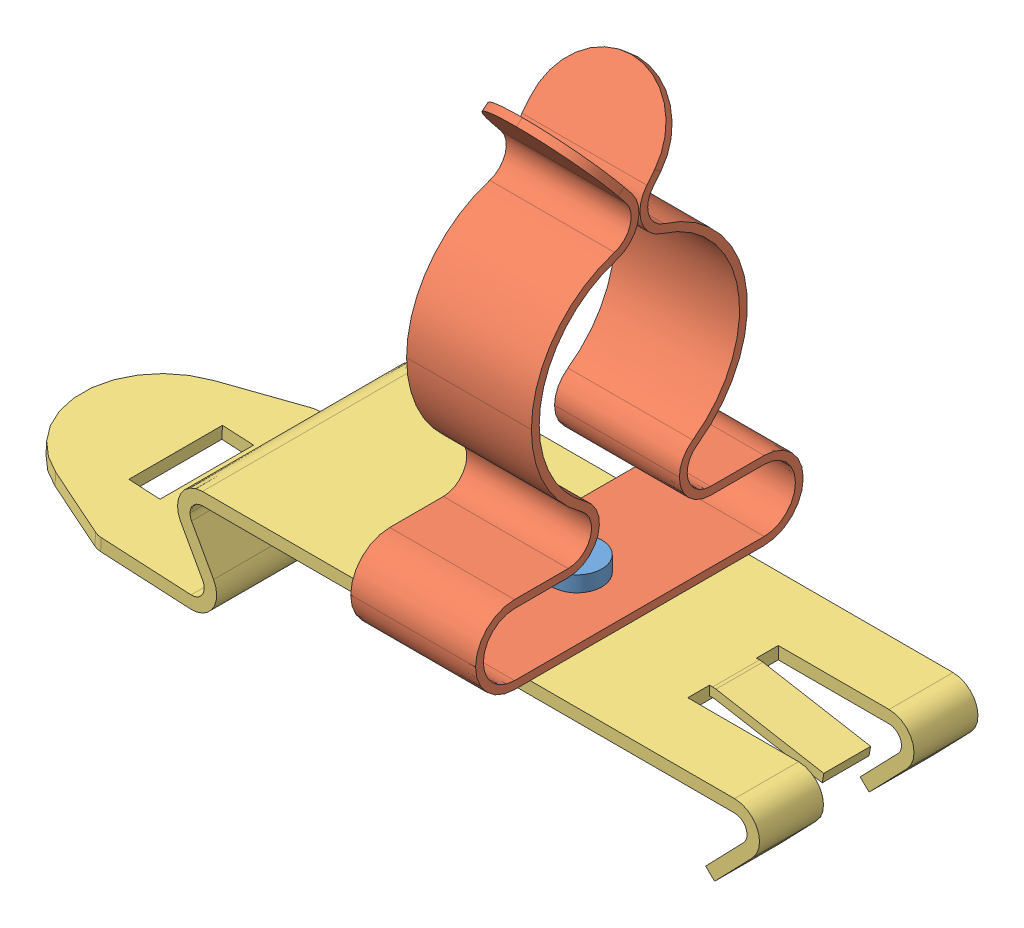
SolidWorks assembly 36247.SLDASM, configuration Default (file format 8000). Lengths in mm.
Overall size (50.45 34.41 21).
3 component instances, 3 part files, 0 mates.
Components (placement in the parent):
- 36247_01-1: 36247_01.SLDPRT [Default] at origin size (6 3.3 6)
- 36247_02-1: 36247_02.SLDPRT [Default] at origin size (8 27.5 21)
- 36247_03-1: 36247_03.SLDPRT [Default] at origin size (50.45 6.91 14)
